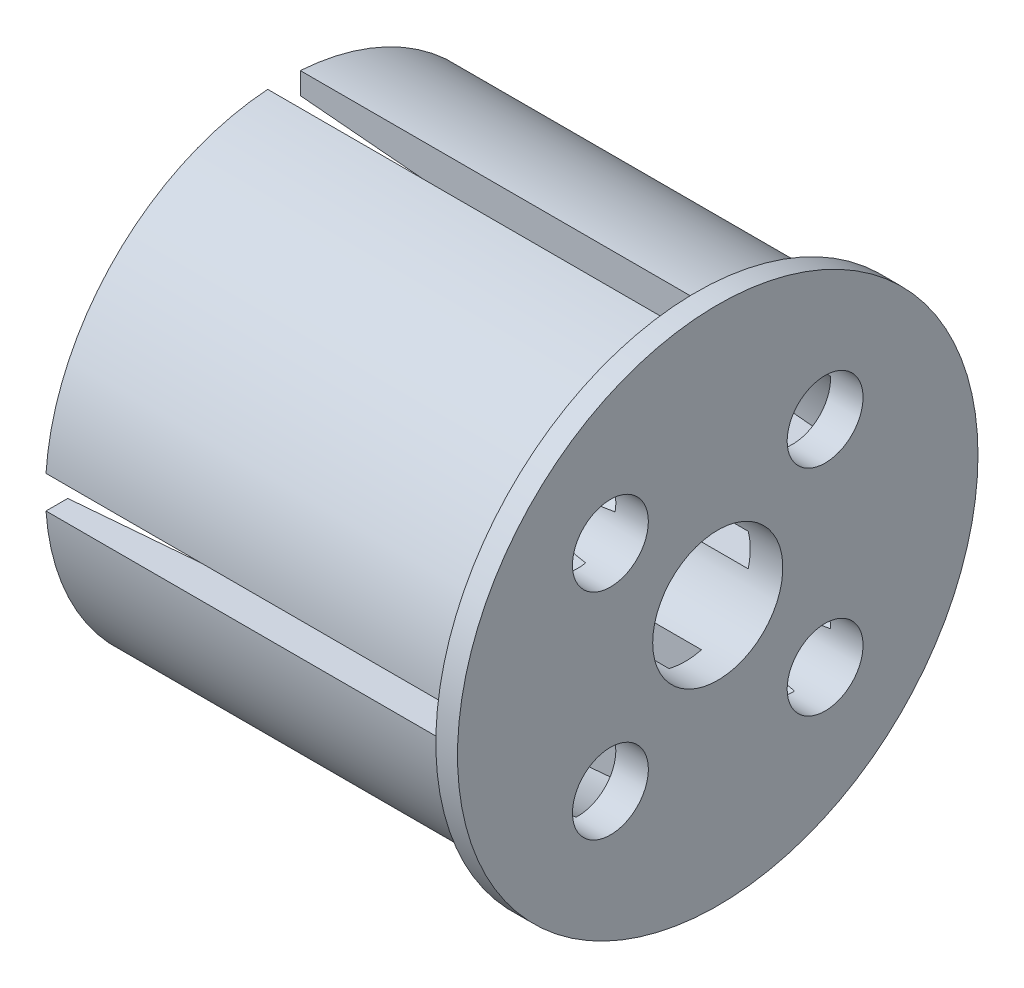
from build123d import *

# Parameters (mm, degrees)
CUT_EXTRUDE1_DEPTH  = 18.5
CUT_EXTRUDE2_DEPTH  = 26.337718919
CIRPATTERN1_COUNT   = 4
BOSS_EXTRUDE1_START = -1
SKETCH4_R           = 12
SKETCH4_R_2         = 11
BOSS_EXTRUDE1_DEPTH = 1


with BuildPart() as part:
    # Sketch1 → Revolve1 (revolve)
    with BuildSketch(Plane.XY, mode=Mode.PRIVATE) as revolve1_sk:
        Polygon((18.5, 5.618540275), (0, 4), (0, 3), (20, 3), (20, 11), (0, 11), (0, 10), (18.5, 8.381459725), align=None)
    revolve(revolve1_sk.sketch.rotate(Axis((0, 0, 0), (1, 0, 0)), 90), axis=Axis((0, 0, 0), (1, 0, 0)))

    # Sketch2 → Cut-Extrude1 (cut)
    with BuildSketch(Plane.ZY):
        with BuildLine():
            Line((-0.75, -0.75), (-0.75, 0.75))
            Line((-0.75, 0.75), (-9.971835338, 0.75))
            ThreePointArc((-9.971835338, 0.75), (-10, 0), (-9.971835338, -0.75))
            Line((-9.971835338, -0.75), (-0.75, -0.75))
        make_face()
        with BuildLine():
            ThreePointArc((11, 0), (10.993598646, 0.375218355), (10.974402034, 0.75))
            Line((10.974402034, 0.75), (9.971835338, 0.75))
            ThreePointArc((9.971835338, 0.75), (9.992956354, 0.375264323), (10, 0))
            ThreePointArc((10, 0), (9.992956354, -0.375264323), (9.971835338, -0.75))
            Line((9.971835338, -0.75), (10.974402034, -0.75))
            ThreePointArc((10.974402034, -0.75), (10.993598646, -0.375218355), (11, 0))
        make_face()
        with BuildLine():
            ThreePointArc((-9.971835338, -0.75), (-10, 0), (-9.971835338, 0.75))
            Line((-9.971835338, 0.75), (-10.974402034, 0.75))
            ThreePointArc((-10.974402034, 0.75), (-10.993598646, 0.375218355), (-11, 0))
            ThreePointArc((-11, 0), (-10.993598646, -0.375218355), (-10.974402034, -0.75))
            Line((-10.974402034, -0.75), (-9.971835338, -0.75))
        make_face()
        with BuildLine():
            Line((0.75, 9.971835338), (0.75, 10.974402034))
            ThreePointArc((0.75, 10.974402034), (0.375218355, 10.993598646), (0, 11))
            ThreePointArc((0, 11), (-0.375218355, 10.993598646), (-0.75, 10.974402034))
            Line((-0.75, 10.974402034), (-0.75, 9.971835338))
            ThreePointArc((-0.75, 9.971835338), (0, 10), (0.75, 9.971835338))
        make_face()
        with BuildLine():
            ThreePointArc((0, -11), (0.375218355, -10.993598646), (0.75, -10.974402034))
            Line((0.75, -10.974402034), (0.75, -9.971835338))
            ThreePointArc((0.75, -9.971835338), (0, -10), (-0.75, -9.971835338))
            Line((-0.75, -9.971835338), (-0.75, -10.974402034))
            ThreePointArc((-0.75, -10.974402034), (-0.375218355, -10.993598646), (0, -11))
        make_face()
        with BuildLine():
            ThreePointArc((11, 0), (10.993598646, 0.375218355), (10.974402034, 0.75))
            Line((10.974402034, 0.75), (9.971835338, 0.75))
            ThreePointArc((9.971835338, 0.75), (9.992956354, 0.375264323), (10, 0))
            ThreePointArc((10, 0), (9.992956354, -0.375264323), (9.971835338, -0.75))
            Line((9.971835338, -0.75), (10.974402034, -0.75))
            ThreePointArc((10.974402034, -0.75), (10.993598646, -0.375218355), (11, 0))
        make_face()
        with BuildLine():
            ThreePointArc((-9.971835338, -0.75), (-10, 0), (-9.971835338, 0.75))
            Line((-9.971835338, 0.75), (-10.974402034, 0.75))
            ThreePointArc((-10.974402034, 0.75), (-10.993598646, 0.375218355), (-11, 0))
            ThreePointArc((-11, 0), (-10.993598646, -0.375218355), (-10.974402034, -0.75))
            Line((-10.974402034, -0.75), (-9.971835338, -0.75))
        make_face()
        with BuildLine():
            Line((0.75, 9.971835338), (0.75, 10.974402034))
            ThreePointArc((0.75, 10.974402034), (0.375218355, 10.993598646), (0, 11))
            ThreePointArc((0, 11), (-0.375218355, 10.993598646), (-0.75, 10.974402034))
            Line((-0.75, 10.974402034), (-0.75, 9.971835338))
            ThreePointArc((-0.75, 9.971835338), (0, 10), (0.75, 9.971835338))
        make_face()
        with BuildLine():
            ThreePointArc((0, -11), (0.375218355, -10.993598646), (0.75, -10.974402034))
            Line((0.75, -10.974402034), (0.75, -9.971835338))
            ThreePointArc((0.75, -9.971835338), (0, -10), (-0.75, -9.971835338))
            Line((-0.75, -9.971835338), (-0.75, -10.974402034))
            ThreePointArc((-0.75, -10.974402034), (-0.375218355, -10.993598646), (0, -11))
        make_face()
        with BuildLine():
            Line((0.75, -9.971835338), (0.75, -0.75))
            Line((0.75, -0.75), (-0.75, -0.75))
            Line((-0.75, -0.75), (-0.75, -9.971835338))
            ThreePointArc((-0.75, -9.971835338), (0, -10), (0.75, -9.971835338))
        make_face()
        with BuildLine():
            ThreePointArc((10, 0), (9.992956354, 0.375264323), (9.971835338, 0.75))
            Line((9.971835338, 0.75), (0.75, 0.75))
            Line((0.75, 0.75), (0.75, -0.75))
            Line((0.75, -0.75), (9.971835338, -0.75))
            ThreePointArc((9.971835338, -0.75), (9.992956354, -0.375264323), (10, 0))
        make_face()
        with BuildLine():
            Line((-0.75, 0.75), (0.75, 0.75))
            Line((0.75, 0.75), (0.75, 9.971835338))
            ThreePointArc((0.75, 9.971835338), (0, 10), (-0.75, 9.971835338))
            Line((-0.75, 9.971835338), (-0.75, 0.75))
        make_face()
    extrude(amount=-CUT_EXTRUDE1_DEPTH, mode=Mode.SUBTRACT)

    # Sketch3 → Cut-Extrude2 (cut, through all)
    with BuildSketch(Plane(origin=(20, 0, 0), x_dir=(0, 0, -1), z_dir=(1, 0, 0))):
        with BuildLine():
            ThreePointArc((-4.949747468, 4.949747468), (-5.529643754, 4.292206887), (-6.02279919, 3.56733653))
            ThreePointArc((-6.02279919, 3.56733653), (-5.516880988, 3.29419331), (-4.949747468, 3.199747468))
            Line((-4.949747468, 3.199747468), (-4.949747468, 4.949747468))
        make_face()
        with BuildLine():
            ThreePointArc((-3.236563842, 4.59267344), (-3.972907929, 3.972907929), (-4.59267344, 3.236563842))
            ThreePointArc((-4.59267344, 3.236563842), (-3.712310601, 3.712310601), (-3.236563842, 4.59267344))
        make_face()
        with BuildLine():
            Line((-4.949747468, 4.949747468), (-4.949747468, 3.199747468))
            ThreePointArc((-4.949747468, 3.199747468), (-4.770263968, 3.208975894), (-4.59267344, 3.236563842))
            ThreePointArc((-4.59267344, 3.236563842), (-3.972907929, 3.972907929), (-3.236563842, 4.59267344))
            ThreePointArc((-3.236563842, 4.59267344), (-3.208975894, 4.770263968), (-3.199747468, 4.949747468))
            Line((-3.199747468, 4.949747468), (-4.949747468, 4.949747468))
        make_face()
        with BuildLine():
            ThreePointArc((-3.199747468, 4.949747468), (-3.29419331, 5.516880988), (-3.56733653, 6.02279919))
            ThreePointArc((-3.56733653, 6.02279919), (-4.292206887, 5.529643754), (-4.949747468, 4.949747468))
            Line((-4.949747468, 4.949747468), (-3.199747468, 4.949747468))
        make_face()
        with BuildLine():
            ThreePointArc((-6.697463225, 5.039132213), (-6.540573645, 4.220520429), (-6.02279919, 3.56733653))
            ThreePointArc((-6.02279919, 3.56733653), (-5.529643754, 4.292206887), (-4.949747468, 4.949747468))
            ThreePointArc((-4.949747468, 4.949747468), (-4.292206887, 5.529643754), (-3.56733653, 6.02279919))
            ThreePointArc((-3.56733653, 6.02279919), (-4.220520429, 6.540573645), (-5.039132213, 6.697463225))
            ThreePointArc((-5.039132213, 6.697463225), (-5.926587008, 5.926587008), (-6.697463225, 5.039132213))
        make_face()
        with BuildLine():
            ThreePointArc((-5.039132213, 6.697463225), (-6.187184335, 6.187184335), (-6.697463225, 5.039132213))
            ThreePointArc((-6.697463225, 5.039132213), (-5.926587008, 5.926587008), (-5.039132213, 6.697463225))
        make_face()
    cut_extrude2 = extrude(amount=-CUT_EXTRUDE2_DEPTH, mode=Mode.SUBTRACT)

    # CirPattern1: Cut-Extrude2 ×4 about axis
    cirpattern1_axis = Axis((0, 0, 0), (1, 0, 0))
    for i in range(1, CIRPATTERN1_COUNT):
        add(cut_extrude2.rotate(cirpattern1_axis, i * 360 / CIRPATTERN1_COUNT), mode=Mode.SUBTRACT)

    # Sketch4 → Boss-Extrude1 (add)
    with BuildSketch(Plane(origin=(20, 0, 0), x_dir=(0, 0, -1), z_dir=(1, 0, 0)).offset(BOSS_EXTRUDE1_START)):
        Circle(SKETCH4_R)
        with Locations(Location((0, 0, 0), (0, 0, 176.090436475))):
            Circle(SKETCH4_R_2, mode=Mode.SUBTRACT)
    extrude(amount=BOSS_EXTRUDE1_DEPTH)


solid = part.part
